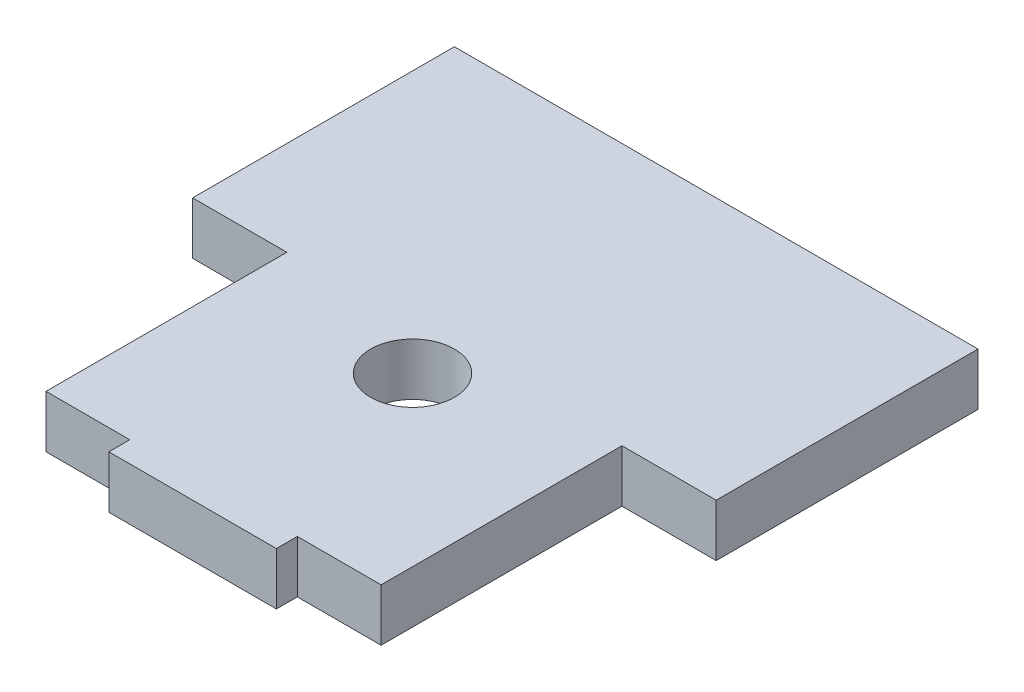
ISO-10303-21;
HEADER;
FILE_DESCRIPTION(('STEP AP214'),'2;1');
FILE_NAME('part.step','',(''),(''),'','','');
FILE_SCHEMA(('AUTOMOTIVE_DESIGN { 1 0 10303 214 1 1 1 1 }'));
ENDSEC;
DATA;
#1=APPLICATION_CONTEXT('core data for automotive mechanical design processes');
#2=APPLICATION_PROTOCOL_DEFINITION('international standard','automotive_design',2000,#1);
#3=PRODUCT_CONTEXT('',#1,'mechanical');
#4=PRODUCT('Part','Part','',(#3));
#5=PRODUCT_RELATED_PRODUCT_CATEGORY('part','',(#4));
#6=PRODUCT_DEFINITION_FORMATION('','',#4);
#7=PRODUCT_DEFINITION_CONTEXT('part definition',#1,'design');
#8=PRODUCT_DEFINITION('design','',#6,#7);
#9=PRODUCT_DEFINITION_SHAPE('','',#8);
#10=(LENGTH_UNIT() NAMED_UNIT(*) SI_UNIT(.MILLI.,.METRE.));
#11=(NAMED_UNIT(*) PLANE_ANGLE_UNIT() SI_UNIT($,.RADIAN.));
#12=(NAMED_UNIT(*) SI_UNIT($,.STERADIAN.) SOLID_ANGLE_UNIT());
#13=UNCERTAINTY_MEASURE_WITH_UNIT(LENGTH_MEASURE(1.E-05),#10,'distance_accuracy_value','');
#14=(GEOMETRIC_REPRESENTATION_CONTEXT(3) GLOBAL_UNCERTAINTY_ASSIGNED_CONTEXT((#13)) GLOBAL_UNIT_ASSIGNED_CONTEXT((#10,
#11,#12)) REPRESENTATION_CONTEXT('',''));
#15=CARTESIAN_POINT('',(0.,0.,0.));
#16=DIRECTION('',(0.,0.,1.));
#17=DIRECTION('',(1.,0.,0.));
#18=AXIS2_PLACEMENT_3D('',#15,#16,#17);
#19=CARTESIAN_POINT('',(50.,5.,-50.));
#20=DIRECTION('',(0.,-1.,0.));
#21=DIRECTION('',(0.,0.,-1.));
#22=AXIS2_PLACEMENT_3D('',#19,#20,#21);
#23=PLANE('',#22);
#24=DIRECTION('',(0.,0.,-1.));
#25=VECTOR('',#24,1.);
#26=CARTESIAN_POINT('',(50.,5.,-25.));
#27=LINE('',#26,#25);
#28=CARTESIAN_POINT('',(50.,5.,-25.));
#29=VERTEX_POINT('',#28);
#30=CARTESIAN_POINT('',(50.,5.,-50.));
#31=VERTEX_POINT('',#30);
#32=EDGE_CURVE('E166',#29,#31,#27,.T.);
#33=ORIENTED_EDGE('',*,*,#32,.T.);
#34=DIRECTION('',(-1.,0.,0.));
#35=VECTOR('',#34,1.);
#36=CARTESIAN_POINT('',(0.,5.,-50.));
#37=LINE('',#36,#35);
#38=CARTESIAN_POINT('',(0.,5.,-50.));
#39=VERTEX_POINT('',#38);
#40=EDGE_CURVE('E135',#31,#39,#37,.T.);
#41=ORIENTED_EDGE('',*,*,#40,.T.);
#42=DIRECTION('',(0.,0.,1.));
#43=VECTOR('',#42,1.);
#44=CARTESIAN_POINT('',(0.,5.,-25.));
#45=LINE('',#44,#43);
#46=CARTESIAN_POINT('',(0.,5.,-25.));
#47=VERTEX_POINT('',#46);
#48=EDGE_CURVE('E169',#39,#47,#45,.T.);
#49=ORIENTED_EDGE('',*,*,#48,.T.);
#50=DIRECTION('',(1.,0.,0.));
#51=VECTOR('',#50,1.);
#52=CARTESIAN_POINT('',(0.,5.,-25.));
#53=LINE('',#52,#51);
#54=CARTESIAN_POINT('',(9.,5.,-25.));
#55=VERTEX_POINT('',#54);
#56=EDGE_CURVE('E171',#47,#55,#53,.T.);
#57=ORIENTED_EDGE('',*,*,#56,.T.);
#58=DIRECTION('',(0.,0.,1.));
#59=VECTOR('',#58,1.);
#60=CARTESIAN_POINT('',(9.,5.,-2.));
#61=LINE('',#60,#59);
#62=CARTESIAN_POINT('',(9.,5.,-2.));
#63=VERTEX_POINT('',#62);
#64=EDGE_CURVE('E173',#55,#63,#61,.T.);
#65=ORIENTED_EDGE('',*,*,#64,.T.);
#66=DIRECTION('',(1.,0.,0.));
#67=VECTOR('',#66,1.);
#68=CARTESIAN_POINT('',(9.,5.,-2.));
#69=LINE('',#68,#67);
#70=CARTESIAN_POINT('',(17.,5.,-2.));
#71=VERTEX_POINT('',#70);
#72=EDGE_CURVE('E175',#63,#71,#69,.T.);
#73=ORIENTED_EDGE('',*,*,#72,.T.);
#74=DIRECTION('',(0.,0.,1.));
#75=VECTOR('',#74,1.);
#76=CARTESIAN_POINT('',(17.,5.,0.));
#77=LINE('',#76,#75);
#78=CARTESIAN_POINT('',(17.,5.,0.));
#79=VERTEX_POINT('',#78);
#80=EDGE_CURVE('E177',#71,#79,#77,.T.);
#81=ORIENTED_EDGE('',*,*,#80,.T.);
#82=DIRECTION('',(1.,0.,0.));
#83=VECTOR('',#82,1.);
#84=CARTESIAN_POINT('',(17.,5.,0.));
#85=LINE('',#84,#83);
#86=CARTESIAN_POINT('',(33.,5.,0.));
#87=VERTEX_POINT('',#86);
#88=EDGE_CURVE('E179',#79,#87,#85,.T.);
#89=ORIENTED_EDGE('',*,*,#88,.T.);
#90=DIRECTION('',(0.,0.,-1.));
#91=VECTOR('',#90,1.);
#92=CARTESIAN_POINT('',(33.,5.,0.));
#93=LINE('',#92,#91);
#94=CARTESIAN_POINT('',(33.,5.,-2.));
#95=VERTEX_POINT('',#94);
#96=EDGE_CURVE('E181',#87,#95,#93,.T.);
#97=ORIENTED_EDGE('',*,*,#96,.T.);
#98=DIRECTION('',(1.,0.,0.));
#99=VECTOR('',#98,1.);
#100=CARTESIAN_POINT('',(33.,5.,-2.));
#101=LINE('',#100,#99);
#102=CARTESIAN_POINT('',(41.,5.,-2.));
#103=VERTEX_POINT('',#102);
#104=EDGE_CURVE('E183',#95,#103,#101,.T.);
#105=ORIENTED_EDGE('',*,*,#104,.T.);
#106=DIRECTION('',(0.,0.,-1.));
#107=VECTOR('',#106,1.);
#108=CARTESIAN_POINT('',(41.,5.,-2.));
#109=LINE('',#108,#107);
#110=CARTESIAN_POINT('',(41.,5.,-25.));
#111=VERTEX_POINT('',#110);
#112=EDGE_CURVE('E52',#103,#111,#109,.T.);
#113=ORIENTED_EDGE('',*,*,#112,.T.);
#114=DIRECTION('',(1.,0.,0.));
#115=VECTOR('',#114,1.);
#116=CARTESIAN_POINT('',(41.,5.,-25.));
#117=LINE('',#116,#115);
#118=EDGE_CURVE('E47',#111,#29,#117,.T.);
#119=ORIENTED_EDGE('',*,*,#118,.T.);
#120=EDGE_LOOP('',(#33,#41,#49,#57,#65,#73,#81,#89,#97,#105,#113,#119));
#121=FACE_BOUND('',#120,.T.);
#122=CARTESIAN_POINT('',(25.,5.,-21.));
#123=DIRECTION('',(0.,1.,0.));
#124=DIRECTION('',(0.,0.,1.));
#125=AXIS2_PLACEMENT_3D('',#122,#123,#124);
#126=CIRCLE('',#125,4.);
#127=CARTESIAN_POINT('',(25.,5.,-17.));
#128=VERTEX_POINT('',#127);
#129=EDGE_CURVE('E140',#128,#128,#126,.T.);
#130=ORIENTED_EDGE('',*,*,#129,.F.);
#131=EDGE_LOOP('',(#130));
#132=FACE_BOUND('',#131,.T.);
#133=ADVANCED_FACE('F32',(#121,#132),#23,.F.);
#134=CARTESIAN_POINT('',(50.,0.,-50.));
#135=DIRECTION('',(0.,-1.,0.));
#136=DIRECTION('',(0.,0.,-1.));
#137=AXIS2_PLACEMENT_3D('',#134,#135,#136);
#138=PLANE('',#137);
#139=DIRECTION('',(0.,0.,-1.));
#140=VECTOR('',#139,1.);
#141=CARTESIAN_POINT('',(50.,0.,-25.));
#142=LINE('',#141,#140);
#143=CARTESIAN_POINT('',(50.,0.,-25.));
#144=VERTEX_POINT('',#143);
#145=CARTESIAN_POINT('',(50.,0.,-50.));
#146=VERTEX_POINT('',#145);
#147=EDGE_CURVE('E126',#144,#146,#142,.T.);
#148=ORIENTED_EDGE('',*,*,#147,.F.);
#149=DIRECTION('',(1.,0.,0.));
#150=VECTOR('',#149,1.);
#151=CARTESIAN_POINT('',(41.,0.,-25.));
#152=LINE('',#151,#150);
#153=CARTESIAN_POINT('',(41.,0.,-25.));
#154=VERTEX_POINT('',#153);
#155=EDGE_CURVE('E164',#154,#144,#152,.T.);
#156=ORIENTED_EDGE('',*,*,#155,.F.);
#157=DIRECTION('',(0.,0.,-1.));
#158=VECTOR('',#157,1.);
#159=CARTESIAN_POINT('',(41.,0.,-2.));
#160=LINE('',#159,#158);
#161=CARTESIAN_POINT('',(41.,0.,-2.));
#162=VERTEX_POINT('',#161);
#163=EDGE_CURVE('E162',#162,#154,#160,.T.);
#164=ORIENTED_EDGE('',*,*,#163,.F.);
#165=DIRECTION('',(1.,0.,0.));
#166=VECTOR('',#165,1.);
#167=CARTESIAN_POINT('',(33.,0.,-2.));
#168=LINE('',#167,#166);
#169=CARTESIAN_POINT('',(33.,0.,-2.));
#170=VERTEX_POINT('',#169);
#171=EDGE_CURVE('E160',#170,#162,#168,.T.);
#172=ORIENTED_EDGE('',*,*,#171,.F.);
#173=DIRECTION('',(0.,0.,-1.));
#174=VECTOR('',#173,1.);
#175=CARTESIAN_POINT('',(33.,0.,0.));
#176=LINE('',#175,#174);
#177=CARTESIAN_POINT('',(33.,0.,0.));
#178=VERTEX_POINT('',#177);
#179=EDGE_CURVE('E158',#178,#170,#176,.T.);
#180=ORIENTED_EDGE('',*,*,#179,.F.);
#181=DIRECTION('',(1.,0.,0.));
#182=VECTOR('',#181,1.);
#183=CARTESIAN_POINT('',(17.,0.,0.));
#184=LINE('',#183,#182);
#185=CARTESIAN_POINT('',(17.,0.,0.));
#186=VERTEX_POINT('',#185);
#187=EDGE_CURVE('E156',#186,#178,#184,.T.);
#188=ORIENTED_EDGE('',*,*,#187,.F.);
#189=DIRECTION('',(0.,0.,1.));
#190=VECTOR('',#189,1.);
#191=CARTESIAN_POINT('',(17.,0.,0.));
#192=LINE('',#191,#190);
#193=CARTESIAN_POINT('',(17.,0.,-2.));
#194=VERTEX_POINT('',#193);
#195=EDGE_CURVE('E154',#194,#186,#192,.T.);
#196=ORIENTED_EDGE('',*,*,#195,.F.);
#197=DIRECTION('',(1.,0.,0.));
#198=VECTOR('',#197,1.);
#199=CARTESIAN_POINT('',(9.,0.,-2.));
#200=LINE('',#199,#198);
#201=CARTESIAN_POINT('',(9.,0.,-2.));
#202=VERTEX_POINT('',#201);
#203=EDGE_CURVE('E152',#202,#194,#200,.T.);
#204=ORIENTED_EDGE('',*,*,#203,.F.);
#205=DIRECTION('',(0.,0.,1.));
#206=VECTOR('',#205,1.);
#207=CARTESIAN_POINT('',(9.,0.,-2.));
#208=LINE('',#207,#206);
#209=CARTESIAN_POINT('',(9.,0.,-25.));
#210=VERTEX_POINT('',#209);
#211=EDGE_CURVE('E150',#210,#202,#208,.T.);
#212=ORIENTED_EDGE('',*,*,#211,.F.);
#213=DIRECTION('',(1.,0.,0.));
#214=VECTOR('',#213,1.);
#215=CARTESIAN_POINT('',(0.,0.,-25.));
#216=LINE('',#215,#214);
#217=CARTESIAN_POINT('',(0.,0.,-25.));
#218=VERTEX_POINT('',#217);
#219=EDGE_CURVE('E148',#218,#210,#216,.T.);
#220=ORIENTED_EDGE('',*,*,#219,.F.);
#221=DIRECTION('',(0.,0.,1.));
#222=VECTOR('',#221,1.);
#223=CARTESIAN_POINT('',(0.,0.,-25.));
#224=LINE('',#223,#222);
#225=CARTESIAN_POINT('',(0.,0.,-50.));
#226=VERTEX_POINT('',#225);
#227=EDGE_CURVE('E128',#226,#218,#224,.T.);
#228=ORIENTED_EDGE('',*,*,#227,.F.);
#229=DIRECTION('',(-1.,0.,0.));
#230=VECTOR('',#229,1.);
#231=CARTESIAN_POINT('',(0.,0.,-50.));
#232=LINE('',#231,#230);
#233=EDGE_CURVE('E121',#146,#226,#232,.T.);
#234=ORIENTED_EDGE('',*,*,#233,.F.);
#235=EDGE_LOOP('',(#148,#156,#164,#172,#180,#188,#196,#204,#212,#220,#228,#234));
#236=FACE_BOUND('',#235,.T.);
#237=CARTESIAN_POINT('',(25.,0.,-21.));
#238=DIRECTION('',(0.,1.,0.));
#239=DIRECTION('',(0.,0.,1.));
#240=AXIS2_PLACEMENT_3D('',#237,#238,#239);
#241=CIRCLE('',#240,4.);
#242=CARTESIAN_POINT('',(25.,0.,-17.));
#243=VERTEX_POINT('',#242);
#244=EDGE_CURVE('E143',#243,#243,#241,.T.);
#245=ORIENTED_EDGE('',*,*,#244,.T.);
#246=EDGE_LOOP('',(#245));
#247=FACE_BOUND('',#246,.T.);
#248=ADVANCED_FACE('F122',(#236,#247),#138,.T.);
#249=CARTESIAN_POINT('',(50.,5.,-25.));
#250=DIRECTION('',(-1.,0.,0.));
#251=DIRECTION('',(0.,0.,1.));
#252=AXIS2_PLACEMENT_3D('',#249,#250,#251);
#253=PLANE('',#252);
#254=ORIENTED_EDGE('',*,*,#147,.T.);
#255=DIRECTION('',(0.,-1.,0.));
#256=VECTOR('',#255,1.);
#257=CARTESIAN_POINT('',(50.,5.,-50.));
#258=LINE('',#257,#256);
#259=EDGE_CURVE('E11',#31,#146,#258,.T.);
#260=ORIENTED_EDGE('',*,*,#259,.F.);
#261=ORIENTED_EDGE('',*,*,#32,.F.);
#262=DIRECTION('',(0.,-1.,0.));
#263=VECTOR('',#262,1.);
#264=CARTESIAN_POINT('',(50.,5.,-25.));
#265=LINE('',#264,#263);
#266=EDGE_CURVE('E139',#29,#144,#265,.T.);
#267=ORIENTED_EDGE('',*,*,#266,.T.);
#268=EDGE_LOOP('',(#254,#260,#261,#267));
#269=FACE_BOUND('',#268,.T.);
#270=ADVANCED_FACE('F34',(#269),#253,.F.);
#271=CARTESIAN_POINT('',(0.,5.,-50.));
#272=DIRECTION('',(0.,0.,1.));
#273=DIRECTION('',(1.,0.,0.));
#274=AXIS2_PLACEMENT_3D('',#271,#272,#273);
#275=PLANE('',#274);
#276=ORIENTED_EDGE('',*,*,#233,.T.);
#277=DIRECTION('',(0.,-1.,0.));
#278=VECTOR('',#277,1.);
#279=CARTESIAN_POINT('',(0.,5.,-50.));
#280=LINE('',#279,#278);
#281=EDGE_CURVE('E40',#39,#226,#280,.T.);
#282=ORIENTED_EDGE('',*,*,#281,.F.);
#283=ORIENTED_EDGE('',*,*,#40,.F.);
#284=ORIENTED_EDGE('',*,*,#259,.T.);
#285=EDGE_LOOP('',(#276,#282,#283,#284));
#286=FACE_BOUND('',#285,.T.);
#287=ADVANCED_FACE('F134',(#286),#275,.F.);
#288=CARTESIAN_POINT('',(0.,5.,-25.));
#289=DIRECTION('',(1.,0.,0.));
#290=DIRECTION('',(0.,0.,-1.));
#291=AXIS2_PLACEMENT_3D('',#288,#289,#290);
#292=PLANE('',#291);
#293=ORIENTED_EDGE('',*,*,#227,.T.);
#294=DIRECTION('',(0.,-1.,0.));
#295=VECTOR('',#294,1.);
#296=CARTESIAN_POINT('',(0.,5.,-25.));
#297=LINE('',#296,#295);
#298=EDGE_CURVE('E212',#47,#218,#297,.T.);
#299=ORIENTED_EDGE('',*,*,#298,.F.);
#300=ORIENTED_EDGE('',*,*,#48,.F.);
#301=ORIENTED_EDGE('',*,*,#281,.T.);
#302=EDGE_LOOP('',(#293,#299,#300,#301));
#303=FACE_BOUND('',#302,.T.);
#304=ADVANCED_FACE('F216',(#303),#292,.F.);
#305=CARTESIAN_POINT('',(0.,5.,-25.));
#306=DIRECTION('',(0.,0.,-1.));
#307=DIRECTION('',(-1.,0.,0.));
#308=AXIS2_PLACEMENT_3D('',#305,#306,#307);
#309=PLANE('',#308);
#310=ORIENTED_EDGE('',*,*,#219,.T.);
#311=DIRECTION('',(0.,-1.,0.));
#312=VECTOR('',#311,1.);
#313=CARTESIAN_POINT('',(9.,5.,-25.));
#314=LINE('',#313,#312);
#315=EDGE_CURVE('E209',#55,#210,#314,.T.);
#316=ORIENTED_EDGE('',*,*,#315,.F.);
#317=ORIENTED_EDGE('',*,*,#56,.F.);
#318=ORIENTED_EDGE('',*,*,#298,.T.);
#319=EDGE_LOOP('',(#310,#316,#317,#318));
#320=FACE_BOUND('',#319,.T.);
#321=ADVANCED_FACE('F224',(#320),#309,.F.);
#322=CARTESIAN_POINT('',(9.,5.,-2.));
#323=DIRECTION('',(1.,0.,0.));
#324=DIRECTION('',(0.,0.,-1.));
#325=AXIS2_PLACEMENT_3D('',#322,#323,#324);
#326=PLANE('',#325);
#327=ORIENTED_EDGE('',*,*,#211,.T.);
#328=DIRECTION('',(0.,-1.,0.));
#329=VECTOR('',#328,1.);
#330=CARTESIAN_POINT('',(9.,5.,-2.));
#331=LINE('',#330,#329);
#332=EDGE_CURVE('E206',#63,#202,#331,.T.);
#333=ORIENTED_EDGE('',*,*,#332,.F.);
#334=ORIENTED_EDGE('',*,*,#64,.F.);
#335=ORIENTED_EDGE('',*,*,#315,.T.);
#336=EDGE_LOOP('',(#327,#333,#334,#335));
#337=FACE_BOUND('',#336,.T.);
#338=ADVANCED_FACE('F227',(#337),#326,.F.);
#339=CARTESIAN_POINT('',(9.,5.,-2.));
#340=DIRECTION('',(0.,0.,-1.));
#341=DIRECTION('',(-1.,0.,0.));
#342=AXIS2_PLACEMENT_3D('',#339,#340,#341);
#343=PLANE('',#342);
#344=ORIENTED_EDGE('',*,*,#203,.T.);
#345=DIRECTION('',(0.,-1.,0.));
#346=VECTOR('',#345,1.);
#347=CARTESIAN_POINT('',(17.,5.,-2.));
#348=LINE('',#347,#346);
#349=EDGE_CURVE('E203',#71,#194,#348,.T.);
#350=ORIENTED_EDGE('',*,*,#349,.F.);
#351=ORIENTED_EDGE('',*,*,#72,.F.);
#352=ORIENTED_EDGE('',*,*,#332,.T.);
#353=EDGE_LOOP('',(#344,#350,#351,#352));
#354=FACE_BOUND('',#353,.T.);
#355=ADVANCED_FACE('F232',(#354),#343,.F.);
#356=CARTESIAN_POINT('',(17.,5.,0.));
#357=DIRECTION('',(1.,0.,0.));
#358=DIRECTION('',(0.,0.,-1.));
#359=AXIS2_PLACEMENT_3D('',#356,#357,#358);
#360=PLANE('',#359);
#361=ORIENTED_EDGE('',*,*,#195,.T.);
#362=DIRECTION('',(0.,-1.,0.));
#363=VECTOR('',#362,1.);
#364=CARTESIAN_POINT('',(17.,5.,0.));
#365=LINE('',#364,#363);
#366=EDGE_CURVE('E200',#79,#186,#365,.T.);
#367=ORIENTED_EDGE('',*,*,#366,.F.);
#368=ORIENTED_EDGE('',*,*,#80,.F.);
#369=ORIENTED_EDGE('',*,*,#349,.T.);
#370=EDGE_LOOP('',(#361,#367,#368,#369));
#371=FACE_BOUND('',#370,.T.);
#372=ADVANCED_FACE('F238',(#371),#360,.F.);
#373=CARTESIAN_POINT('',(17.,5.,0.));
#374=DIRECTION('',(0.,0.,-1.));
#375=DIRECTION('',(-1.,0.,0.));
#376=AXIS2_PLACEMENT_3D('',#373,#374,#375);
#377=PLANE('',#376);
#378=ORIENTED_EDGE('',*,*,#187,.T.);
#379=DIRECTION('',(0.,-1.,0.));
#380=VECTOR('',#379,1.);
#381=CARTESIAN_POINT('',(33.,5.,0.));
#382=LINE('',#381,#380);
#383=EDGE_CURVE('E197',#87,#178,#382,.T.);
#384=ORIENTED_EDGE('',*,*,#383,.F.);
#385=ORIENTED_EDGE('',*,*,#88,.F.);
#386=ORIENTED_EDGE('',*,*,#366,.T.);
#387=EDGE_LOOP('',(#378,#384,#385,#386));
#388=FACE_BOUND('',#387,.T.);
#389=ADVANCED_FACE('F242',(#388),#377,.F.);
#390=CARTESIAN_POINT('',(33.,5.,0.));
#391=DIRECTION('',(-1.,0.,0.));
#392=DIRECTION('',(0.,0.,1.));
#393=AXIS2_PLACEMENT_3D('',#390,#391,#392);
#394=PLANE('',#393);
#395=ORIENTED_EDGE('',*,*,#179,.T.);
#396=DIRECTION('',(0.,-1.,0.));
#397=VECTOR('',#396,1.);
#398=CARTESIAN_POINT('',(33.,5.,-2.));
#399=LINE('',#398,#397);
#400=EDGE_CURVE('E194',#95,#170,#399,.T.);
#401=ORIENTED_EDGE('',*,*,#400,.F.);
#402=ORIENTED_EDGE('',*,*,#96,.F.);
#403=ORIENTED_EDGE('',*,*,#383,.T.);
#404=EDGE_LOOP('',(#395,#401,#402,#403));
#405=FACE_BOUND('',#404,.T.);
#406=ADVANCED_FACE('F247',(#405),#394,.F.);
#407=CARTESIAN_POINT('',(33.,5.,-2.));
#408=DIRECTION('',(0.,0.,-1.));
#409=DIRECTION('',(-1.,0.,0.));
#410=AXIS2_PLACEMENT_3D('',#407,#408,#409);
#411=PLANE('',#410);
#412=ORIENTED_EDGE('',*,*,#171,.T.);
#413=DIRECTION('',(0.,-1.,0.));
#414=VECTOR('',#413,1.);
#415=CARTESIAN_POINT('',(41.,5.,-2.));
#416=LINE('',#415,#414);
#417=EDGE_CURVE('E191',#103,#162,#416,.T.);
#418=ORIENTED_EDGE('',*,*,#417,.F.);
#419=ORIENTED_EDGE('',*,*,#104,.F.);
#420=ORIENTED_EDGE('',*,*,#400,.T.);
#421=EDGE_LOOP('',(#412,#418,#419,#420));
#422=FACE_BOUND('',#421,.T.);
#423=ADVANCED_FACE('F251',(#422),#411,.F.);
#424=CARTESIAN_POINT('',(41.,5.,-2.));
#425=DIRECTION('',(-1.,0.,0.));
#426=DIRECTION('',(0.,0.,1.));
#427=AXIS2_PLACEMENT_3D('',#424,#425,#426);
#428=PLANE('',#427);
#429=ORIENTED_EDGE('',*,*,#163,.T.);
#430=DIRECTION('',(0.,-1.,0.));
#431=VECTOR('',#430,1.);
#432=CARTESIAN_POINT('',(41.,5.,-25.));
#433=LINE('',#432,#431);
#434=EDGE_CURVE('E188',#111,#154,#433,.T.);
#435=ORIENTED_EDGE('',*,*,#434,.F.);
#436=ORIENTED_EDGE('',*,*,#112,.F.);
#437=ORIENTED_EDGE('',*,*,#417,.T.);
#438=EDGE_LOOP('',(#429,#435,#436,#437));
#439=FACE_BOUND('',#438,.T.);
#440=ADVANCED_FACE('F255',(#439),#428,.F.);
#441=CARTESIAN_POINT('',(41.,5.,-25.));
#442=DIRECTION('',(0.,0.,-1.));
#443=DIRECTION('',(-1.,0.,0.));
#444=AXIS2_PLACEMENT_3D('',#441,#442,#443);
#445=PLANE('',#444);
#446=ORIENTED_EDGE('',*,*,#155,.T.);
#447=ORIENTED_EDGE('',*,*,#266,.F.);
#448=ORIENTED_EDGE('',*,*,#118,.F.);
#449=ORIENTED_EDGE('',*,*,#434,.T.);
#450=EDGE_LOOP('',(#446,#447,#448,#449));
#451=FACE_BOUND('',#450,.T.);
#452=ADVANCED_FACE('F257',(#451),#445,.F.);
#453=CARTESIAN_POINT('',(25.,5.,-21.));
#454=DIRECTION('',(0.,-1.,0.));
#455=DIRECTION('',(0.,0.,-1.));
#456=AXIS2_PLACEMENT_3D('',#453,#454,#455);
#457=CYLINDRICAL_SURFACE('',#456,4.);
#458=ORIENTED_EDGE('',*,*,#129,.T.);
#459=EDGE_LOOP('',(#458));
#460=FACE_BOUND('',#459,.T.);
#461=ORIENTED_EDGE('',*,*,#244,.F.);
#462=EDGE_LOOP('',(#461));
#463=FACE_BOUND('',#462,.T.);
#464=ADVANCED_FACE('F259',(#460,#463),#457,.F.);
#465=CLOSED_SHELL('',(#133,#248,#270,#287,#304,#321,#338,#355,#372,#389,#406,#423,#440,#452,#464));
#466=MANIFOLD_SOLID_BREP('B2',#465);
#467=ADVANCED_BREP_SHAPE_REPRESENTATION('',(#18,#466),#14);
#468=SHAPE_DEFINITION_REPRESENTATION(#9,#467);
ENDSEC;
END-ISO-10303-21;
